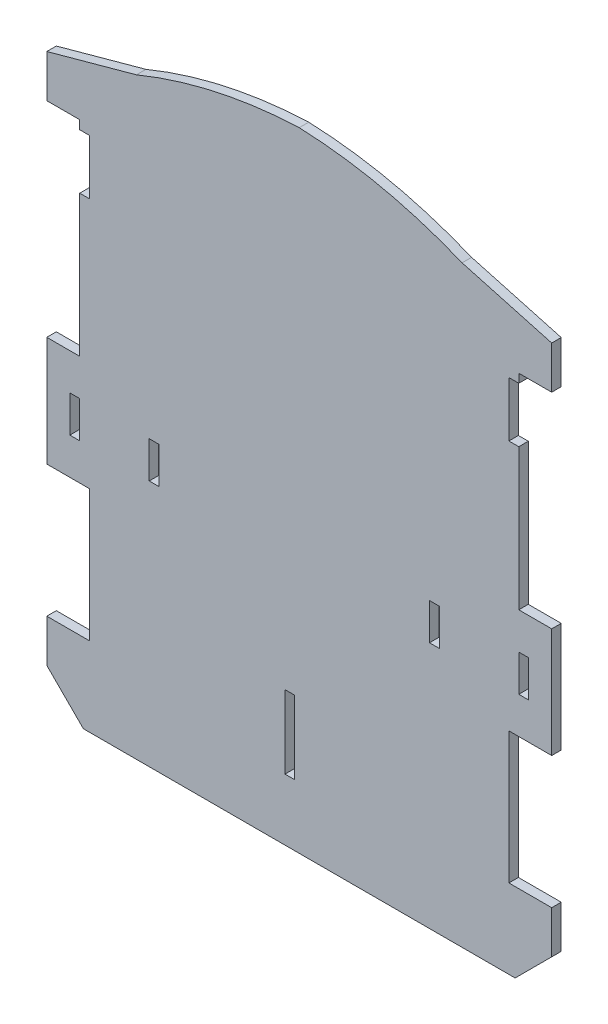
from build123d import *

# Parameters (mm, degrees)
CROQUIS1_W              = 2.7
CROQUIS1_H              = 10
CROQUIS1_W_2            = 2.6
CROQUIS1_H_2            = 20
SALIENTE_EXTRUIR1_DEPTH = 2.6


with BuildPart() as part:
    # Croquis1 → Saliente-Extruir1 (new body)
    with BuildSketch(Plane.XY):
        with BuildLine():
            Line((66.186289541, -36.882062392), (77.886289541, -36.882062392))
            Line((77.886289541, -36.882062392), (77.886289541, -6.882062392))
            Line((77.886289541, -6.882062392), (68.886289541, -6.882062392))
            Line((68.886289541, -6.882062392), (68.886289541, 31.727937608))
            Line((68.886289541, 31.727937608), (66.186289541, 31.727937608))
            Line((66.186289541, 31.727937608), (66.186289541, 46.734389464))
            Line((66.186289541, 46.734389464), (68.886289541, 46.734389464))
            Line((68.886289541, 46.734389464), (68.886289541, 49.117937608))
            Line((68.886289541, 49.117937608), (77.886289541, 49.117937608))
            Line((77.886289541, 49.117937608), (77.886289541, 60.76290403))
            Line((77.886289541, 60.76290403), (53.386289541, 67.493883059))
            ThreePointArc((53.386289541, 67.493883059), (31.567722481, 74.33395887), (8.886289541, 77.230354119))
            ThreePointArc((8.886289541, 77.230354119), (-13.795143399, 74.33395887), (-35.613710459, 67.493883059))
            Line((-35.613710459, 67.493883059), (-60.113710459, 60.76290403))
            Line((-60.113710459, 60.76290403), (-60.113710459, 49.117937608))
            Line((-60.113710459, 49.117937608), (-51.113710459, 49.117937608))
            Line((-51.113710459, 49.117937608), (-51.113710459, 46.734389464))
            Line((-51.113710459, 46.734389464), (-48.413710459, 46.734389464))
            Line((-48.413710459, 46.734389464), (-48.413710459, 31.727937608))
            Line((-48.413710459, 31.727937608), (-51.113710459, 31.727937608))
            Line((-51.113710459, 31.727937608), (-51.113710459, -6.882062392))
            Line((-51.113710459, -6.882062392), (-60.113710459, -6.882062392))
            Line((-60.113710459, -6.882062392), (-60.113710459, -36.882062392))
            Line((-60.113710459, -36.882062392), (-48.413710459, -36.882062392))
            Line((-48.413710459, -36.882062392), (-48.413710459, -72.882062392))
            Line((-48.413710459, -72.882062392), (-60.113710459, -72.882062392))
            Line((-60.113710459, -72.882062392), (-60.113710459, -84.527028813))
            Line((-60.113710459, -84.527028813), (-50.113710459, -94.527028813))
            Line((-50.113710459, -94.527028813), (67.886289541, -94.527028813))
            Line((67.886289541, -94.527028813), (77.886289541, -84.527028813))
            Line((77.886289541, -84.527028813), (77.886289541, -72.882062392))
            Line((77.886289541, -72.882062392), (66.186289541, -72.882062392))
            Line((66.186289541, -72.882062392), (66.186289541, -36.882062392))
        make_face()
        with Locations((70.236289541, -21.882062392)):
            Rectangle(CROQUIS1_W, CROQUIS1_H, mode=Mode.SUBTRACT)
        with Locations((45.836289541, -21.882062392)):
            Rectangle(CROQUIS1_W, CROQUIS1_H, mode=Mode.SUBTRACT)
        with Locations((6.286289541, -67.715367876)):
            Rectangle(CROQUIS1_W_2, CROQUIS1_H_2, mode=Mode.SUBTRACT)
        with Locations((-52.463710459, -21.882062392)):
            Rectangle(CROQUIS1_W, CROQUIS1_H, mode=Mode.SUBTRACT)
        with Locations((-30.763710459, -21.882062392)):
            Rectangle(CROQUIS1_W, CROQUIS1_H, mode=Mode.SUBTRACT)
    extrude(amount=SALIENTE_EXTRUIR1_DEPTH)


solid = part.part
